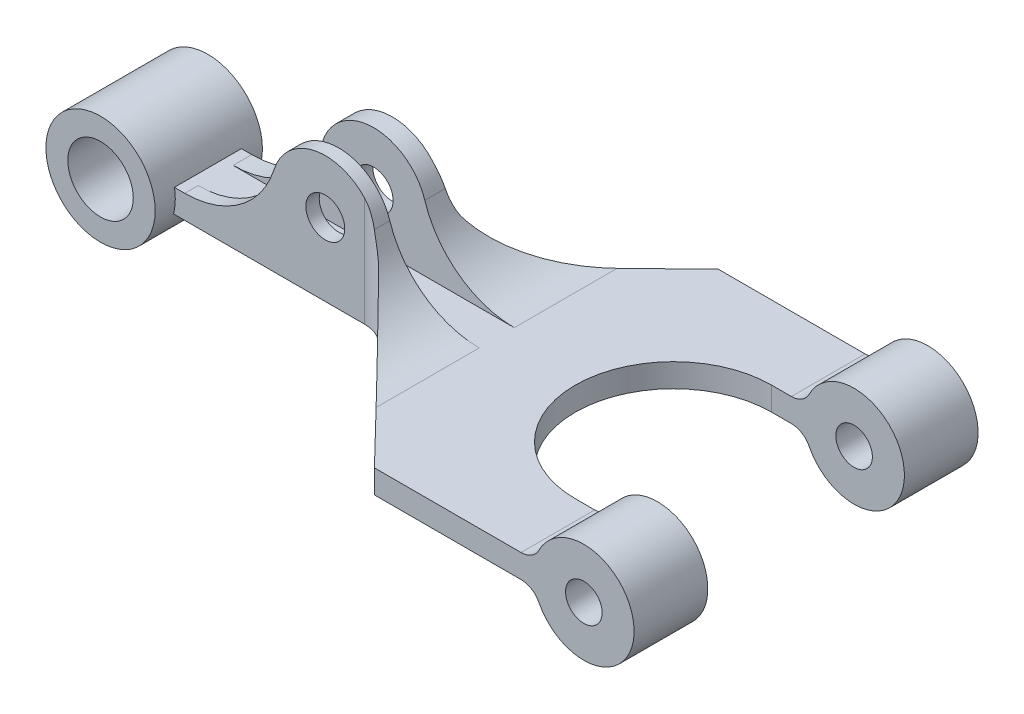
from build123d import *

# Parameters (mm, degrees)
SKETCH1_R           = 8
SKETCH1_R_2         = 2.9
EXTRUDE1_DEPTH      = 10
EXTRUDE2_DEPTH      = 0.5
EXTRUDE2_DEPTH_BACK = 3
SKETCH4_W           = 5.227994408
SKETCH4_H           = 18.151774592
CUT_EXTRUDE1_DEPTH  = 104.178109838
FILLET4_R           = 14
SKETCH6_R           = 7.5
SKETCH6_R_2         = 2.726604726
EXTRUDE4_DEPTH      = 11
EXTRUDE6_DEPTH      = 3
EXTRUDE6_DEPTH_BACK = 13
SKETCH11_R          = 8.15177363
SKETCH11_R_2        = 4.885123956
EXTRUDE7_START      = 11
SKETCH8_R           = 7.5
SKETCH8_R_2         = 2.725
EXTRUDE7_DEPTH      = 11
FILLET19_R          = 3
FILLET23_R          = 5


with BuildPart() as part:
    # Sketch1 → Extrude1 (new body)
    with BuildSketch(Plane.XY):
        with Locations((12.741128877, -63.13435232)):
            Circle(SKETCH1_R)
        with Locations((12.741128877, -63.13435232)):
            Circle(SKETCH1_R_2, mode=Mode.SUBTRACT)
    extrude(amount=-EXTRUDE1_DEPTH)

    # Sketch2 → Extrude2 (add, two sides: drawn at the far end of the back side and taken through both)
    with BuildSketch(Plane(origin=(0, -71, 0), x_dir=(-1, 0, 0), z_dir=(0, 1, 0)).offset(-EXTRUDE2_DEPTH_BACK)):
        with BuildLine():
            Line((-12.741128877, 0), (12.908426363, 0))
            Line((12.908426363, 0), (12.908426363, -10))
            Line((12.908426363, -10), (-12.741128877, -10))
            Line((-12.741128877, -10), (-20.741128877, -10))
            Line((-20.741128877, -10), (-41.392249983, -30))
            Line((-41.392249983, -30), (-65.343112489, -30))
            Line((-65.343112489, -30), (-65.343112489, -19))
            Line((-65.343112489, -19), (-60.343112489, -19))
            ThreePointArc((-60.343112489, -19), (-45.681392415, -4.338279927), (-60.343112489, 10.323440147))
            Line((-60.343112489, 10.323440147), (-65.343112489, 10.323440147))
            Line((-65.343112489, 10.323440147), (-65.343112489, 21.323440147))
            Line((-65.343112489, 21.323440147), (-41.392249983, 21.323440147))
            Line((-41.392249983, 21.323440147), (-20.741128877, 0))
            Line((-20.741128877, 0), (-12.741128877, 0))
        make_face()
    extrude(amount=EXTRUDE2_DEPTH + EXTRUDE2_DEPTH_BACK)

    # Sketch4 → Cut-Extrude1 (cut, through all)
    with BuildSketch(Plane(origin=(0, 0, 0), x_dir=(0, 0, -1), z_dir=(1, 0, 0))):
        with Locations((4.605888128, -61.424112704)):
            Rectangle(SKETCH4_W, SKETCH4_H)
    extrude(amount=CUT_EXTRUDE1_DEPTH, mode=Mode.SUBTRACT)

    # Fillet4
    fillet4_edges = [part.edges().sort_by_distance(p)[0] for p in [
        (9.619072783, -70.5, -0.995945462),
        (15.863184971, -70.5, -8.609942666),
        (15.863184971, -70.5, -0.995945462),
        (9.619072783, -70.5, -8.609942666),
    ]]
    fillet(fillet4_edges, radius=FILLET4_R)

    # Sketch6 → Extrude4 (add)
    with BuildSketch(Plane.XY.offset(21.323440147)):
        with Locations((72.636088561, -72.25)):
            Circle(SKETCH6_R)
        with Locations((72.636088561, -72.25)):
            Circle(SKETCH6_R_2, mode=Mode.SUBTRACT)
    extrude(amount=-EXTRUDE4_DEPTH)

    # Sketch11 → Extrude6 (add, two sides: drawn at the far end of the back side and taken through both)
    with BuildSketch(Plane.XY.offset(-EXTRUDE6_DEPTH_BACK)):
        with Locations((-17.793550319, -71.960171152)):
            Circle(SKETCH11_R)
        with Locations((-17.793550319, -71.960171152)):
            Circle(SKETCH11_R_2, mode=Mode.SUBTRACT)
    extrude(amount=EXTRUDE6_DEPTH + EXTRUDE6_DEPTH_BACK)

    # Sketch8 → Extrude7 (add)
    with BuildSketch(Plane.XY.offset(-30).offset(EXTRUDE7_START)):
        with Locations((72.636088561, -72.25)):
            Circle(SKETCH8_R)
        with Locations((72.636088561, -72.25)):
            Circle(SKETCH8_R_2, mode=Mode.SUBTRACT)
    extrude(amount=-EXTRUDE7_DEPTH)

    # Fillet19
    fillet19_edges = [part.edges().sort_by_distance(p)[0] for p in [
        (65.343112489, -74, 15.823440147),
        (65.343112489, -74, -24.5),
        (65.343112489, -70.5, 15.823440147),
        (65.343112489, -70.5, -24.5),
    ]]
    fillet(fillet19_edges, radius=FILLET19_R)

    # Fillet23
    fillet23_edges = [part.edges().sort_by_distance(p)[0] for p in [
        (20.741128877, -67.878111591, -10),
        (20.741128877, -67.878111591, 0),
    ]]
    fillet(fillet23_edges, radius=FILLET23_R)


solid = part.part
